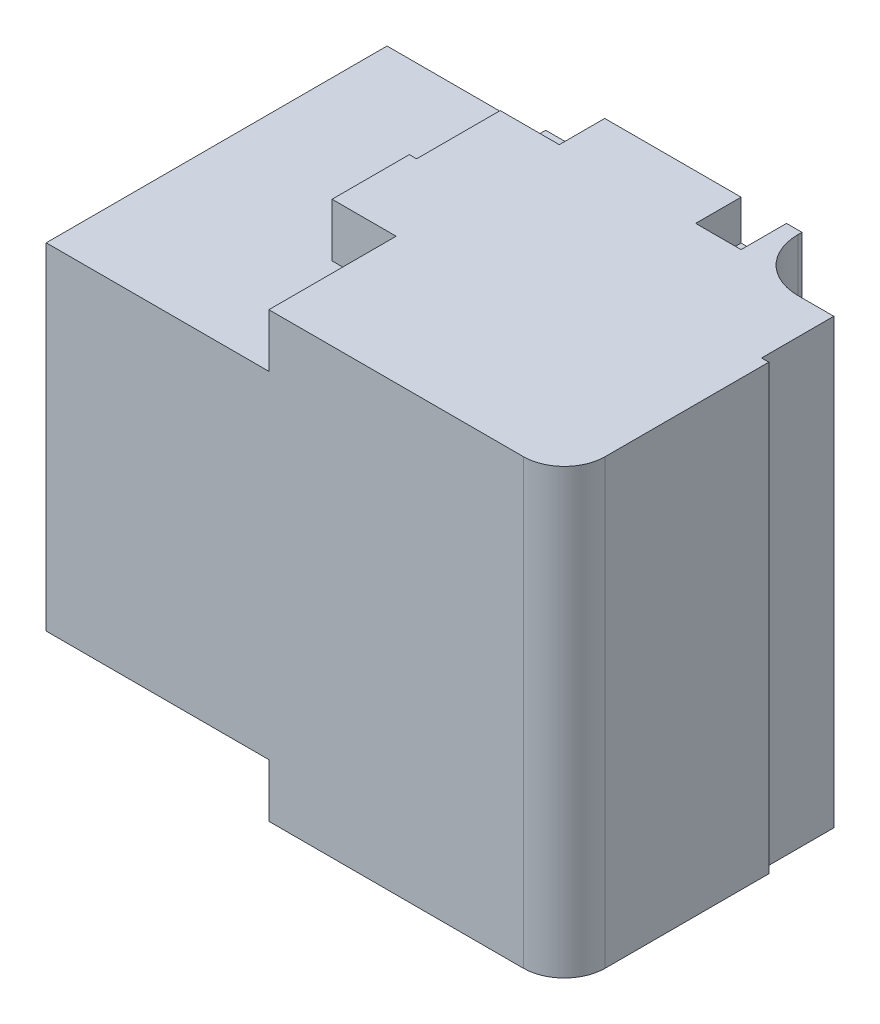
ISO-10303-21;
HEADER;
FILE_DESCRIPTION(('STEP AP214'),'2;1');
FILE_NAME('part.step','',(''),(''),'','','');
FILE_SCHEMA(('AUTOMOTIVE_DESIGN { 1 0 10303 214 1 1 1 1 }'));
ENDSEC;
DATA;
#1=APPLICATION_CONTEXT('core data for automotive mechanical design processes');
#2=APPLICATION_PROTOCOL_DEFINITION('international standard','automotive_design',2000,#1);
#3=PRODUCT_CONTEXT('',#1,'mechanical');
#4=PRODUCT('Part','Part','',(#3));
#5=PRODUCT_RELATED_PRODUCT_CATEGORY('part','',(#4));
#6=PRODUCT_DEFINITION_FORMATION('','',#4);
#7=PRODUCT_DEFINITION_CONTEXT('part definition',#1,'design');
#8=PRODUCT_DEFINITION('design','',#6,#7);
#9=PRODUCT_DEFINITION_SHAPE('','',#8);
#10=(LENGTH_UNIT() NAMED_UNIT(*) SI_UNIT(.MILLI.,.METRE.));
#11=(NAMED_UNIT(*) PLANE_ANGLE_UNIT() SI_UNIT($,.RADIAN.));
#12=(NAMED_UNIT(*) SI_UNIT($,.STERADIAN.) SOLID_ANGLE_UNIT());
#13=UNCERTAINTY_MEASURE_WITH_UNIT(LENGTH_MEASURE(1.E-05),#10,'distance_accuracy_value','');
#14=(GEOMETRIC_REPRESENTATION_CONTEXT(3) GLOBAL_UNCERTAINTY_ASSIGNED_CONTEXT((#13)) GLOBAL_UNIT_ASSIGNED_CONTEXT((#10,
#11,#12)) REPRESENTATION_CONTEXT('',''));
#15=CARTESIAN_POINT('',(0.,0.,0.));
#16=DIRECTION('',(0.,0.,1.));
#17=DIRECTION('',(1.,0.,0.));
#18=AXIS2_PLACEMENT_3D('',#15,#16,#17);
#19=CARTESIAN_POINT('',(114.935,50.8,52.832));
#20=DIRECTION('',(0.,-1.,0.));
#21=DIRECTION('',(0.,0.,-1.));
#22=AXIS2_PLACEMENT_3D('',#19,#20,#21);
#23=PLANE('',#22);
#24=DIRECTION('',(-1.,0.,0.));
#25=VECTOR('',#24,1.);
#26=CARTESIAN_POINT('',(0.,50.8,65.532));
#27=LINE('',#26,#25);
#28=CARTESIAN_POINT('',(114.935,50.8,65.532));
#29=VERTEX_POINT('',#28);
#30=CARTESIAN_POINT('',(102.235,50.8,65.532));
#31=VERTEX_POINT('',#30);
#32=EDGE_CURVE('E507',#29,#31,#27,.T.);
#33=ORIENTED_EDGE('',*,*,#32,.F.);
#34=DIRECTION('',(0.,0.,-1.));
#35=VECTOR('',#34,1.);
#36=CARTESIAN_POINT('',(114.935,50.8,52.832));
#37=LINE('',#36,#35);
#38=CARTESIAN_POINT('',(114.935,50.8,52.832));
#39=VERTEX_POINT('',#38);
#40=EDGE_CURVE('E513',#29,#39,#37,.T.);
#41=ORIENTED_EDGE('',*,*,#40,.T.);
#42=DIRECTION('',(1.,0.,0.));
#43=VECTOR('',#42,1.);
#44=CARTESIAN_POINT('',(45.593,50.8,52.832));
#45=LINE('',#44,#43);
#46=CARTESIAN_POINT('',(102.235,50.8,52.832));
#47=VERTEX_POINT('',#46);
#48=EDGE_CURVE('E380',#39,#47,#45,.F.);
#49=ORIENTED_EDGE('',*,*,#48,.T.);
#50=DIRECTION('',(0.,0.,1.));
#51=VECTOR('',#50,1.);
#52=CARTESIAN_POINT('',(102.235,50.8,52.832));
#53=LINE('',#52,#51);
#54=EDGE_CURVE('E505',#47,#31,#53,.T.);
#55=ORIENTED_EDGE('',*,*,#54,.T.);
#56=EDGE_LOOP('',(#33,#41,#49,#55));
#57=FACE_BOUND('',#56,.T.);
#58=ADVANCED_FACE('F17',(#57),#23,.F.);
#59=CARTESIAN_POINT('',(64.135,50.8,52.832));
#60=DIRECTION('',(0.,-1.,0.));
#61=DIRECTION('',(0.,0.,-1.));
#62=AXIS2_PLACEMENT_3D('',#59,#60,#61);
#63=PLANE('',#62);
#64=DIRECTION('',(0.,0.,-1.));
#65=VECTOR('',#64,1.);
#66=CARTESIAN_POINT('',(64.135,50.8,52.832));
#67=LINE('',#66,#65);
#68=CARTESIAN_POINT('',(64.135,50.8,65.532));
#69=VERTEX_POINT('',#68);
#70=CARTESIAN_POINT('',(64.135,50.8,52.832));
#71=VERTEX_POINT('',#70);
#72=EDGE_CURVE('E504',#69,#71,#67,.T.);
#73=ORIENTED_EDGE('',*,*,#72,.T.);
#74=DIRECTION('',(1.,0.,0.));
#75=VECTOR('',#74,1.);
#76=CARTESIAN_POINT('',(45.593,50.8,52.832));
#77=LINE('',#76,#75);
#78=CARTESIAN_POINT('',(47.625,50.8,52.832));
#79=VERTEX_POINT('',#78);
#80=EDGE_CURVE('E494',#71,#79,#77,.F.);
#81=ORIENTED_EDGE('',*,*,#80,.T.);
#82=DIRECTION('',(0.,0.,1.));
#83=VECTOR('',#82,1.);
#84=CARTESIAN_POINT('',(47.625,50.8,146.05));
#85=LINE('',#84,#83);
#86=CARTESIAN_POINT('',(47.625,50.8,65.532));
#87=VERTEX_POINT('',#86);
#88=EDGE_CURVE('E483',#87,#79,#85,.F.);
#89=ORIENTED_EDGE('',*,*,#88,.F.);
#90=DIRECTION('',(-1.,0.,0.));
#91=VECTOR('',#90,1.);
#92=CARTESIAN_POINT('',(0.,50.8,65.532));
#93=LINE('',#92,#91);
#94=EDGE_CURVE('E614',#69,#87,#93,.T.);
#95=ORIENTED_EDGE('',*,*,#94,.F.);
#96=EDGE_LOOP('',(#73,#81,#89,#95));
#97=FACE_BOUND('',#96,.T.);
#98=ADVANCED_FACE('F1075',(#97),#63,.F.);
#99=CARTESIAN_POINT('',(119.253,-61.9125,50.8));
#100=DIRECTION('',(-1.,0.,0.));
#101=DIRECTION('',(0.,0.,1.));
#102=AXIS2_PLACEMENT_3D('',#99,#100,#101);
#103=PLANE('',#102);
#104=DIRECTION('',(0.,1.,0.));
#105=VECTOR('',#104,1.);
#106=CARTESIAN_POINT('',(119.253,-74.295,52.832));
#107=LINE('',#106,#105);
#108=CARTESIAN_POINT('',(119.253,-61.9125,52.832));
#109=VERTEX_POINT('',#108);
#110=CARTESIAN_POINT('',(119.253,61.9125,52.832));
#111=VERTEX_POINT('',#110);
#112=EDGE_CURVE('E386',#109,#111,#107,.T.);
#113=ORIENTED_EDGE('',*,*,#112,.T.);
#114=DIRECTION('',(0.,0.,1.));
#115=VECTOR('',#114,1.);
#116=CARTESIAN_POINT('',(119.253,61.9125,50.8));
#117=LINE('',#116,#115);
#118=CARTESIAN_POINT('',(119.253,61.9125,53.975));
#119=VERTEX_POINT('',#118);
#120=EDGE_CURVE('E560',#119,#111,#117,.F.);
#121=ORIENTED_EDGE('',*,*,#120,.F.);
#122=DIRECTION('',(0.,-1.,0.));
#123=VECTOR('',#122,1.);
#124=CARTESIAN_POINT('',(119.253,223.33077,53.975));
#125=LINE('',#124,#123);
#126=CARTESIAN_POINT('',(119.253,-61.9125,53.975));
#127=VERTEX_POINT('',#126);
#128=EDGE_CURVE('E372',#119,#127,#125,.T.);
#129=ORIENTED_EDGE('',*,*,#128,.T.);
#130=DIRECTION('',(0.,0.,1.));
#131=VECTOR('',#130,1.);
#132=CARTESIAN_POINT('',(119.253,-61.9125,50.8));
#133=LINE('',#132,#131);
#134=EDGE_CURVE('E516',#109,#127,#133,.T.);
#135=ORIENTED_EDGE('',*,*,#134,.F.);
#136=EDGE_LOOP('',(#113,#121,#129,#135));
#137=FACE_BOUND('',#136,.T.);
#138=ADVANCED_FACE('F760',(#137),#103,.F.);
#139=CARTESIAN_POINT('',(45.593,-50.8,52.832));
#140=DIRECTION('',(0.,1.,0.));
#141=DIRECTION('',(0.,0.,1.));
#142=AXIS2_PLACEMENT_3D('',#139,#140,#141);
#143=PLANE('',#142);
#144=DIRECTION('',(0.,0.,-1.));
#145=VECTOR('',#144,1.);
#146=CARTESIAN_POINT('',(114.935,-50.8,52.832));
#147=LINE('',#146,#145);
#148=CARTESIAN_POINT('',(114.935,-50.8,52.832));
#149=VERTEX_POINT('',#148);
#150=CARTESIAN_POINT('',(114.935,-50.8,65.532));
#151=VERTEX_POINT('',#150);
#152=EDGE_CURVE('E592',#149,#151,#147,.F.);
#153=ORIENTED_EDGE('',*,*,#152,.T.);
#154=DIRECTION('',(-1.,0.,0.));
#155=VECTOR('',#154,1.);
#156=CARTESIAN_POINT('',(0.,-50.8,65.532));
#157=LINE('',#156,#155);
#158=CARTESIAN_POINT('',(47.625,-50.8,65.532));
#159=VERTEX_POINT('',#158);
#160=EDGE_CURVE('E407',#159,#151,#157,.F.);
#161=ORIENTED_EDGE('',*,*,#160,.F.);
#162=DIRECTION('',(0.,0.,1.));
#163=VECTOR('',#162,1.);
#164=CARTESIAN_POINT('',(47.625,-50.8,146.05));
#165=LINE('',#164,#163);
#166=CARTESIAN_POINT('',(47.625,-50.8,52.832));
#167=VERTEX_POINT('',#166);
#168=EDGE_CURVE('E431',#167,#159,#165,.T.);
#169=ORIENTED_EDGE('',*,*,#168,.F.);
#170=DIRECTION('',(1.,0.,0.));
#171=VECTOR('',#170,1.);
#172=CARTESIAN_POINT('',(45.593,-50.8,52.832));
#173=LINE('',#172,#171);
#174=EDGE_CURVE('E537',#167,#149,#173,.T.);
#175=ORIENTED_EDGE('',*,*,#174,.T.);
#176=EDGE_LOOP('',(#153,#161,#169,#175));
#177=FACE_BOUND('',#176,.T.);
#178=ADVANCED_FACE('F753',(#177),#143,.F.);
#179=CARTESIAN_POINT('',(114.935,61.9125,52.832));
#180=DIRECTION('',(1.,0.,0.));
#181=DIRECTION('',(0.,0.,-1.));
#182=AXIS2_PLACEMENT_3D('',#179,#180,#181);
#183=PLANE('',#182);
#184=ORIENTED_EDGE('',*,*,#40,.F.);
#185=DIRECTION('',(0.,1.,0.));
#186=VECTOR('',#185,1.);
#187=CARTESIAN_POINT('',(114.935,-74.295,65.532));
#188=LINE('',#187,#186);
#189=CARTESIAN_POINT('',(114.935,61.9125,65.532));
#190=VERTEX_POINT('',#189);
#191=EDGE_CURVE('E510',#190,#29,#188,.F.);
#192=ORIENTED_EDGE('',*,*,#191,.F.);
#193=DIRECTION('',(0.,0.,1.));
#194=VECTOR('',#193,1.);
#195=CARTESIAN_POINT('',(114.935,61.9125,50.8));
#196=LINE('',#195,#194);
#197=CARTESIAN_POINT('',(114.935,61.9125,52.832));
#198=VERTEX_POINT('',#197);
#199=EDGE_CURVE('E329',#198,#190,#196,.T.);
#200=ORIENTED_EDGE('',*,*,#199,.F.);
#201=DIRECTION('',(0.,1.,0.));
#202=VECTOR('',#201,1.);
#203=CARTESIAN_POINT('',(114.935,-74.295,52.832));
#204=LINE('',#203,#202);
#205=EDGE_CURVE('E383',#198,#39,#204,.F.);
#206=ORIENTED_EDGE('',*,*,#205,.T.);
#207=EDGE_LOOP('',(#184,#192,#200,#206));
#208=FACE_BOUND('',#207,.T.);
#209=ADVANCED_FACE('F1048',(#208),#183,.F.);
#210=CARTESIAN_POINT('',(0.,-74.295,65.532));
#211=DIRECTION('',(0.,0.,-1.));
#212=DIRECTION('',(-1.,0.,0.));
#213=AXIS2_PLACEMENT_3D('',#210,#211,#212);
#214=PLANE('',#213);
#215=DIRECTION('',(0.,1.,0.));
#216=VECTOR('',#215,1.);
#217=CARTESIAN_POINT('',(102.235,50.8,65.532));
#218=LINE('',#217,#216);
#219=CARTESIAN_POINT('',(102.235,61.9125,65.532));
#220=VERTEX_POINT('',#219);
#221=EDGE_CURVE('E501',#31,#220,#218,.T.);
#222=ORIENTED_EDGE('',*,*,#221,.T.);
#223=DIRECTION('',(1.,0.,0.));
#224=VECTOR('',#223,1.);
#225=CARTESIAN_POINT('',(146.05,61.9125,65.532));
#226=LINE('',#225,#224);
#227=EDGE_CURVE('E326',#190,#220,#226,.F.);
#228=ORIENTED_EDGE('',*,*,#227,.F.);
#229=ORIENTED_EDGE('',*,*,#191,.T.);
#230=ORIENTED_EDGE('',*,*,#32,.T.);
#231=EDGE_LOOP('',(#222,#228,#229,#230));
#232=FACE_BOUND('',#231,.T.);
#233=ADVANCED_FACE('F1039',(#232),#214,.T.);
#234=CARTESIAN_POINT('',(102.235,50.8,52.832));
#235=DIRECTION('',(-1.,0.,0.));
#236=DIRECTION('',(0.,0.,1.));
#237=AXIS2_PLACEMENT_3D('',#234,#235,#236);
#238=PLANE('',#237);
#239=ORIENTED_EDGE('',*,*,#54,.F.);
#240=DIRECTION('',(0.,1.,0.));
#241=VECTOR('',#240,1.);
#242=CARTESIAN_POINT('',(102.235,-74.295,52.832));
#243=LINE('',#242,#241);
#244=CARTESIAN_POINT('',(102.235,61.9125,52.832));
#245=VERTEX_POINT('',#244);
#246=EDGE_CURVE('E376',#47,#245,#243,.T.);
#247=ORIENTED_EDGE('',*,*,#246,.T.);
#248=DIRECTION('',(0.,0.,1.));
#249=VECTOR('',#248,1.);
#250=CARTESIAN_POINT('',(102.235,61.9125,50.8));
#251=LINE('',#250,#249);
#252=EDGE_CURVE('E322',#220,#245,#251,.F.);
#253=ORIENTED_EDGE('',*,*,#252,.F.);
#254=ORIENTED_EDGE('',*,*,#221,.F.);
#255=EDGE_LOOP('',(#239,#247,#253,#254));
#256=FACE_BOUND('',#255,.T.);
#257=ADVANCED_FACE('F1029',(#256),#238,.F.);
#258=CARTESIAN_POINT('',(64.135,61.9125,52.832));
#259=DIRECTION('',(1.,0.,0.));
#260=DIRECTION('',(0.,0.,-1.));
#261=AXIS2_PLACEMENT_3D('',#258,#259,#260);
#262=PLANE('',#261);
#263=ORIENTED_EDGE('',*,*,#72,.F.);
#264=DIRECTION('',(0.,1.,0.));
#265=VECTOR('',#264,1.);
#266=CARTESIAN_POINT('',(64.135,-74.295,65.532));
#267=LINE('',#266,#265);
#268=CARTESIAN_POINT('',(64.135,61.9125,65.532));
#269=VERTEX_POINT('',#268);
#270=EDGE_CURVE('E580',#269,#69,#267,.F.);
#271=ORIENTED_EDGE('',*,*,#270,.F.);
#272=DIRECTION('',(0.,0.,1.));
#273=VECTOR('',#272,1.);
#274=CARTESIAN_POINT('',(64.135,61.9125,50.8));
#275=LINE('',#274,#273);
#276=CARTESIAN_POINT('',(64.135,61.9125,52.832));
#277=VERTEX_POINT('',#276);
#278=EDGE_CURVE('E583',#277,#269,#275,.T.);
#279=ORIENTED_EDGE('',*,*,#278,.F.);
#280=DIRECTION('',(0.,1.,0.));
#281=VECTOR('',#280,1.);
#282=CARTESIAN_POINT('',(64.135,-74.295,52.832));
#283=LINE('',#282,#281);
#284=EDGE_CURVE('E379',#277,#71,#283,.F.);
#285=ORIENTED_EDGE('',*,*,#284,.T.);
#286=EDGE_LOOP('',(#263,#271,#279,#285));
#287=FACE_BOUND('',#286,.T.);
#288=ADVANCED_FACE('F1020',(#287),#262,.F.);
#289=CARTESIAN_POINT('',(0.,-74.295,65.532));
#290=DIRECTION('',(0.,0.,-1.));
#291=DIRECTION('',(-1.,0.,0.));
#292=AXIS2_PLACEMENT_3D('',#289,#290,#291);
#293=PLANE('',#292);
#294=ORIENTED_EDGE('',*,*,#94,.T.);
#295=DIRECTION('',(0.,1.,0.));
#296=VECTOR('',#295,1.);
#297=CARTESIAN_POINT('',(47.625,0.,65.532));
#298=LINE('',#297,#296);
#299=CARTESIAN_POINT('',(47.625,61.9125,65.532));
#300=VERTEX_POINT('',#299);
#301=EDGE_CURVE('E569',#300,#87,#298,.F.);
#302=ORIENTED_EDGE('',*,*,#301,.F.);
#303=DIRECTION('',(1.,0.,0.));
#304=VECTOR('',#303,1.);
#305=CARTESIAN_POINT('',(146.05,61.9125,65.532));
#306=LINE('',#305,#304);
#307=EDGE_CURVE('E534',#269,#300,#306,.F.);
#308=ORIENTED_EDGE('',*,*,#307,.F.);
#309=ORIENTED_EDGE('',*,*,#270,.T.);
#310=EDGE_LOOP('',(#294,#302,#308,#309));
#311=FACE_BOUND('',#310,.T.);
#312=ADVANCED_FACE('F1011',(#311),#293,.T.);
#313=CARTESIAN_POINT('',(47.625,0.,146.05));
#314=DIRECTION('',(-1.,0.,0.));
#315=DIRECTION('',(0.,0.,1.));
#316=AXIS2_PLACEMENT_3D('',#313,#314,#315);
#317=PLANE('',#316);
#318=DIRECTION('',(0.,1.,0.));
#319=VECTOR('',#318,1.);
#320=CARTESIAN_POINT('',(47.625,46.99,88.9));
#321=LINE('',#320,#319);
#322=CARTESIAN_POINT('',(47.625,46.99,88.9));
#323=VERTEX_POINT('',#322);
#324=CARTESIAN_POINT('',(47.625,61.9125,88.9));
#325=VERTEX_POINT('',#324);
#326=EDGE_CURVE('E475',#323,#325,#321,.T.);
#327=ORIENTED_EDGE('',*,*,#326,.T.);
#328=DIRECTION('',(0.,0.,1.));
#329=VECTOR('',#328,1.);
#330=CARTESIAN_POINT('',(47.625,61.9125,50.8));
#331=LINE('',#330,#329);
#332=EDGE_CURVE('E458',#300,#325,#331,.T.);
#333=ORIENTED_EDGE('',*,*,#332,.F.);
#334=ORIENTED_EDGE('',*,*,#301,.T.);
#335=ORIENTED_EDGE('',*,*,#88,.T.);
#336=DIRECTION('',(0.,1.,0.));
#337=VECTOR('',#336,1.);
#338=CARTESIAN_POINT('',(47.625,-74.295,52.832));
#339=LINE('',#338,#337);
#340=CARTESIAN_POINT('',(47.625,46.99,52.832));
#341=VERTEX_POINT('',#340);
#342=EDGE_CURVE('E421',#79,#341,#339,.F.);
#343=ORIENTED_EDGE('',*,*,#342,.T.);
#344=DIRECTION('',(0.,0.,-1.));
#345=VECTOR('',#344,1.);
#346=CARTESIAN_POINT('',(47.625,46.99,146.05));
#347=LINE('',#346,#345);
#348=EDGE_CURVE('E479',#341,#323,#347,.F.);
#349=ORIENTED_EDGE('',*,*,#348,.T.);
#350=EDGE_LOOP('',(#327,#333,#334,#335,#343,#349));
#351=FACE_BOUND('',#350,.T.);
#352=ADVANCED_FACE('F736',(#351),#317,.T.);
#353=CARTESIAN_POINT('',(45.593,46.99,88.9));
#354=DIRECTION('',(0.,0.,1.));
#355=DIRECTION('',(1.,0.,0.));
#356=AXIS2_PLACEMENT_3D('',#353,#354,#355);
#357=PLANE('',#356);
#358=DIRECTION('',(1.,0.,0.));
#359=VECTOR('',#358,1.);
#360=CARTESIAN_POINT('',(1.27,46.99,88.9));
#361=LINE('',#360,#359);
#362=CARTESIAN_POINT('',(45.593,46.99,88.9));
#363=VERTEX_POINT('',#362);
#364=EDGE_CURVE('E471',#323,#363,#361,.F.);
#365=ORIENTED_EDGE('',*,*,#364,.T.);
#366=DIRECTION('',(0.,1.,0.));
#367=VECTOR('',#366,1.);
#368=CARTESIAN_POINT('',(45.593,46.99,88.9));
#369=LINE('',#368,#367);
#370=CARTESIAN_POINT('',(45.593,61.9125,88.9));
#371=VERTEX_POINT('',#370);
#372=EDGE_CURVE('E467',#363,#371,#369,.T.);
#373=ORIENTED_EDGE('',*,*,#372,.T.);
#374=DIRECTION('',(1.,0.,0.));
#375=VECTOR('',#374,1.);
#376=CARTESIAN_POINT('',(146.05,61.9125,88.9));
#377=LINE('',#376,#375);
#378=EDGE_CURVE('E356',#325,#371,#377,.F.);
#379=ORIENTED_EDGE('',*,*,#378,.F.);
#380=ORIENTED_EDGE('',*,*,#326,.F.);
#381=EDGE_LOOP('',(#365,#373,#379,#380));
#382=FACE_BOUND('',#381,.T.);
#383=ADVANCED_FACE('F733',(#382),#357,.F.);
#384=CARTESIAN_POINT('',(45.593,46.99,146.05));
#385=DIRECTION('',(1.,0.,0.));
#386=DIRECTION('',(0.,0.,-1.));
#387=AXIS2_PLACEMENT_3D('',#384,#385,#386);
#388=PLANE('',#387);
#389=DIRECTION('',(0.,1.,0.));
#390=VECTOR('',#389,1.);
#391=CARTESIAN_POINT('',(45.593,0.,110.49));
#392=LINE('',#391,#390);
#393=CARTESIAN_POINT('',(45.593,61.9125,110.49));
#394=VERTEX_POINT('',#393);
#395=CARTESIAN_POINT('',(45.593,46.99,110.49));
#396=VERTEX_POINT('',#395);
#397=EDGE_CURVE('E408',#394,#396,#392,.F.);
#398=ORIENTED_EDGE('',*,*,#397,.F.);
#399=DIRECTION('',(0.,0.,1.));
#400=VECTOR('',#399,1.);
#401=CARTESIAN_POINT('',(45.593,61.9125,50.8));
#402=LINE('',#401,#400);
#403=EDGE_CURVE('E498',#371,#394,#402,.T.);
#404=ORIENTED_EDGE('',*,*,#403,.F.);
#405=ORIENTED_EDGE('',*,*,#372,.F.);
#406=DIRECTION('',(0.,0.,-1.));
#407=VECTOR('',#406,1.);
#408=CARTESIAN_POINT('',(45.593,46.99,146.05));
#409=LINE('',#408,#407);
#410=EDGE_CURVE('E462',#363,#396,#409,.F.);
#411=ORIENTED_EDGE('',*,*,#410,.T.);
#412=EDGE_LOOP('',(#398,#404,#405,#411));
#413=FACE_BOUND('',#412,.T.);
#414=ADVANCED_FACE('F728',(#413),#388,.F.);
#415=CARTESIAN_POINT('',(0.,0.,110.49));
#416=DIRECTION('',(0.,0.,1.));
#417=DIRECTION('',(1.,0.,0.));
#418=AXIS2_PLACEMENT_3D('',#415,#416,#417);
#419=PLANE('',#418);
#420=DIRECTION('',(0.,1.,0.));
#421=VECTOR('',#420,1.);
#422=CARTESIAN_POINT('',(63.5,46.99,110.49));
#423=LINE('',#422,#421);
#424=CARTESIAN_POINT('',(63.5,46.99,110.49));
#425=VERTEX_POINT('',#424);
#426=CARTESIAN_POINT('',(63.5,61.9125,110.49));
#427=VERTEX_POINT('',#426);
#428=EDGE_CURVE('E315',#425,#427,#423,.T.);
#429=ORIENTED_EDGE('',*,*,#428,.T.);
#430=DIRECTION('',(1.,0.,0.));
#431=VECTOR('',#430,1.);
#432=CARTESIAN_POINT('',(146.05,61.9125,110.49));
#433=LINE('',#432,#431);
#434=EDGE_CURVE('E339',#394,#427,#433,.T.);
#435=ORIENTED_EDGE('',*,*,#434,.F.);
#436=ORIENTED_EDGE('',*,*,#397,.T.);
#437=DIRECTION('',(1.,0.,0.));
#438=VECTOR('',#437,1.);
#439=CARTESIAN_POINT('',(1.27,46.99,110.49));
#440=LINE('',#439,#438);
#441=EDGE_CURVE('E306',#396,#425,#440,.T.);
#442=ORIENTED_EDGE('',*,*,#441,.T.);
#443=EDGE_LOOP('',(#429,#435,#436,#442));
#444=FACE_BOUND('',#443,.T.);
#445=ADVANCED_FACE('F722',(#444),#419,.T.);
#446=CARTESIAN_POINT('',(45.593,-74.295,50.8));
#447=DIRECTION('',(-1.,0.,0.));
#448=DIRECTION('',(0.,0.,1.));
#449=AXIS2_PLACEMENT_3D('',#446,#447,#448);
#450=PLANE('',#449);
#451=DIRECTION('',(0.,0.,-1.));
#452=VECTOR('',#451,1.);
#453=CARTESIAN_POINT('',(45.593,46.99,146.05));
#454=LINE('',#453,#452);
#455=CARTESIAN_POINT('',(45.593,46.99,50.8));
#456=VERTEX_POINT('',#455);
#457=CARTESIAN_POINT('',(45.593,46.99,52.832));
#458=VERTEX_POINT('',#457);
#459=EDGE_CURVE('E314',#456,#458,#454,.F.);
#460=ORIENTED_EDGE('',*,*,#459,.T.);
#461=DIRECTION('',(0.,1.,0.));
#462=VECTOR('',#461,1.);
#463=CARTESIAN_POINT('',(45.593,-74.295,52.832));
#464=LINE('',#463,#462);
#465=CARTESIAN_POINT('',(45.593,-46.99,52.832));
#466=VERTEX_POINT('',#465);
#467=EDGE_CURVE('E375',#458,#466,#464,.F.);
#468=ORIENTED_EDGE('',*,*,#467,.T.);
#469=DIRECTION('',(0.,0.,1.));
#470=VECTOR('',#469,1.);
#471=CARTESIAN_POINT('',(45.593,-46.99,146.05));
#472=LINE('',#471,#470);
#473=CARTESIAN_POINT('',(45.593,-46.99,50.8));
#474=VERTEX_POINT('',#473);
#475=EDGE_CURVE('E402',#466,#474,#472,.F.);
#476=ORIENTED_EDGE('',*,*,#475,.T.);
#477=DIRECTION('',(0.,1.,0.));
#478=VECTOR('',#477,1.);
#479=CARTESIAN_POINT('',(45.593,0.,50.8));
#480=LINE('',#479,#478);
#481=EDGE_CURVE('E405',#474,#456,#480,.T.);
#482=ORIENTED_EDGE('',*,*,#481,.T.);
#483=EDGE_LOOP('',(#460,#468,#476,#482));
#484=FACE_BOUND('',#483,.T.);
#485=ADVANCED_FACE('F746',(#484),#450,.F.);
#486=CARTESIAN_POINT('',(0.,0.,50.8));
#487=DIRECTION('',(0.,0.,1.));
#488=DIRECTION('',(1.,0.,0.));
#489=AXIS2_PLACEMENT_3D('',#486,#487,#488);
#490=PLANE('',#489);
#491=DIRECTION('',(0.,1.,0.));
#492=VECTOR('',#491,1.);
#493=CARTESIAN_POINT('',(1.27,61.9125,50.8));
#494=LINE('',#493,#492);
#495=CARTESIAN_POINT('',(1.27,46.99,50.8));
#496=VERTEX_POINT('',#495);
#497=CARTESIAN_POINT('',(1.27,-46.99,50.8));
#498=VERTEX_POINT('',#497);
#499=EDGE_CURVE('E295',#496,#498,#494,.F.);
#500=ORIENTED_EDGE('',*,*,#499,.F.);
#501=DIRECTION('',(1.,0.,0.));
#502=VECTOR('',#501,1.);
#503=CARTESIAN_POINT('',(1.27,46.99,50.8));
#504=LINE('',#503,#502);
#505=EDGE_CURVE('E296',#496,#456,#504,.T.);
#506=ORIENTED_EDGE('',*,*,#505,.T.);
#507=ORIENTED_EDGE('',*,*,#481,.F.);
#508=DIRECTION('',(1.,0.,0.));
#509=VECTOR('',#508,1.);
#510=CARTESIAN_POINT('',(45.593,-46.99,50.8));
#511=LINE('',#510,#509);
#512=EDGE_CURVE('E284',#474,#498,#511,.F.);
#513=ORIENTED_EDGE('',*,*,#512,.T.);
#514=EDGE_LOOP('',(#500,#506,#507,#513));
#515=FACE_BOUND('',#514,.T.);
#516=ADVANCED_FACE('F708',(#515),#490,.F.);
#517=CARTESIAN_POINT('',(0.,-74.295,65.532));
#518=DIRECTION('',(0.,0.,-1.));
#519=DIRECTION('',(-1.,0.,0.));
#520=AXIS2_PLACEMENT_3D('',#517,#518,#519);
#521=PLANE('',#520);
#522=DIRECTION('',(1.,0.,0.));
#523=VECTOR('',#522,1.);
#524=CARTESIAN_POINT('',(1.27,-61.9125,65.532));
#525=LINE('',#524,#523);
#526=CARTESIAN_POINT('',(47.625,-61.9125,65.532));
#527=VERTEX_POINT('',#526);
#528=CARTESIAN_POINT('',(114.935,-61.9125,65.532));
#529=VERTEX_POINT('',#528);
#530=EDGE_CURVE('E249',#527,#529,#525,.T.);
#531=ORIENTED_EDGE('',*,*,#530,.F.);
#532=DIRECTION('',(0.,1.,0.));
#533=VECTOR('',#532,1.);
#534=CARTESIAN_POINT('',(47.625,0.,65.532));
#535=LINE('',#534,#533);
#536=EDGE_CURVE('E357',#159,#527,#535,.F.);
#537=ORIENTED_EDGE('',*,*,#536,.F.);
#538=ORIENTED_EDGE('',*,*,#160,.T.);
#539=DIRECTION('',(0.,1.,0.));
#540=VECTOR('',#539,1.);
#541=CARTESIAN_POINT('',(114.935,-50.8,65.532));
#542=LINE('',#541,#540);
#543=EDGE_CURVE('E540',#151,#529,#542,.F.);
#544=ORIENTED_EDGE('',*,*,#543,.T.);
#545=EDGE_LOOP('',(#531,#537,#538,#544));
#546=FACE_BOUND('',#545,.T.);
#547=ADVANCED_FACE('F676',(#546),#521,.T.);
#548=CARTESIAN_POINT('',(114.935,-50.8,52.832));
#549=DIRECTION('',(1.,0.,0.));
#550=DIRECTION('',(0.,0.,-1.));
#551=AXIS2_PLACEMENT_3D('',#548,#549,#550);
#552=PLANE('',#551);
#553=ORIENTED_EDGE('',*,*,#152,.F.);
#554=DIRECTION('',(0.,1.,0.));
#555=VECTOR('',#554,1.);
#556=CARTESIAN_POINT('',(114.935,-74.295,52.832));
#557=LINE('',#556,#555);
#558=CARTESIAN_POINT('',(114.935,-61.9125,52.832));
#559=VERTEX_POINT('',#558);
#560=EDGE_CURVE('E539',#149,#559,#557,.F.);
#561=ORIENTED_EDGE('',*,*,#560,.T.);
#562=DIRECTION('',(0.,0.,-1.));
#563=VECTOR('',#562,1.);
#564=CARTESIAN_POINT('',(114.935,-61.9125,50.8));
#565=LINE('',#564,#563);
#566=EDGE_CURVE('E246',#529,#559,#565,.T.);
#567=ORIENTED_EDGE('',*,*,#566,.F.);
#568=ORIENTED_EDGE('',*,*,#543,.F.);
#569=EDGE_LOOP('',(#553,#561,#567,#568));
#570=FACE_BOUND('',#569,.T.);
#571=ADVANCED_FACE('F755',(#570),#552,.F.);
#572=CARTESIAN_POINT('',(45.593,-74.295,52.832));
#573=DIRECTION('',(0.,0.,1.));
#574=DIRECTION('',(1.,0.,0.));
#575=AXIS2_PLACEMENT_3D('',#572,#573,#574);
#576=PLANE('',#575);
#577=ORIENTED_EDGE('',*,*,#467,.F.);
#578=DIRECTION('',(1.,0.,0.));
#579=VECTOR('',#578,1.);
#580=CARTESIAN_POINT('',(1.27,46.99,52.832));
#581=LINE('',#580,#579);
#582=EDGE_CURVE('E454',#458,#341,#581,.T.);
#583=ORIENTED_EDGE('',*,*,#582,.T.);
#584=ORIENTED_EDGE('',*,*,#342,.F.);
#585=ORIENTED_EDGE('',*,*,#80,.F.);
#586=ORIENTED_EDGE('',*,*,#284,.F.);
#587=DIRECTION('',(1.,0.,0.));
#588=VECTOR('',#587,1.);
#589=CARTESIAN_POINT('',(146.05,61.9125,52.832));
#590=LINE('',#589,#588);
#591=EDGE_CURVE('E325',#245,#277,#590,.F.);
#592=ORIENTED_EDGE('',*,*,#591,.F.);
#593=ORIENTED_EDGE('',*,*,#246,.F.);
#594=ORIENTED_EDGE('',*,*,#48,.F.);
#595=ORIENTED_EDGE('',*,*,#205,.F.);
#596=DIRECTION('',(1.,0.,0.));
#597=VECTOR('',#596,1.);
#598=CARTESIAN_POINT('',(146.05,61.9125,52.832));
#599=LINE('',#598,#597);
#600=EDGE_CURVE('E332',#111,#198,#599,.F.);
#601=ORIENTED_EDGE('',*,*,#600,.F.);
#602=ORIENTED_EDGE('',*,*,#112,.F.);
#603=DIRECTION('',(1.,0.,0.));
#604=VECTOR('',#603,1.);
#605=CARTESIAN_POINT('',(1.27,-61.9125,52.832));
#606=LINE('',#605,#604);
#607=EDGE_CURVE('E239',#559,#109,#606,.T.);
#608=ORIENTED_EDGE('',*,*,#607,.F.);
#609=ORIENTED_EDGE('',*,*,#560,.F.);
#610=ORIENTED_EDGE('',*,*,#174,.F.);
#611=DIRECTION('',(0.,1.,0.));
#612=VECTOR('',#611,1.);
#613=CARTESIAN_POINT('',(47.625,0.,52.832));
#614=LINE('',#613,#612);
#615=CARTESIAN_POINT('',(47.625,-46.99,52.832));
#616=VERTEX_POINT('',#615);
#617=EDGE_CURVE('E428',#616,#167,#614,.F.);
#618=ORIENTED_EDGE('',*,*,#617,.F.);
#619=DIRECTION('',(1.,0.,0.));
#620=VECTOR('',#619,1.);
#621=CARTESIAN_POINT('',(45.593,-46.99,52.832));
#622=LINE('',#621,#620);
#623=EDGE_CURVE('E412',#616,#466,#622,.F.);
#624=ORIENTED_EDGE('',*,*,#623,.T.);
#625=EDGE_LOOP('',(#577,#583,#584,#585,#586,#592,#593,#594,#595,#601,#602,#608,#609,#610,#618,#624));
#626=FACE_BOUND('',#625,.T.);
#627=ADVANCED_FACE('F742',(#626),#576,.F.);
#628=CARTESIAN_POINT('',(133.985,223.33077,53.975));
#629=DIRECTION('',(0.,-1.,0.));
#630=DIRECTION('',(0.,0.,-1.));
#631=AXIS2_PLACEMENT_3D('',#628,#629,#630);
#632=CYLINDRICAL_SURFACE('',#631,14.732);
#633=ORIENTED_EDGE('',*,*,#128,.F.);
#634=CARTESIAN_POINT('',(133.985,61.9125,53.975));
#635=DIRECTION('',(0.,-1.,0.));
#636=DIRECTION('',(0.,0.,-1.));
#637=AXIS2_PLACEMENT_3D('',#634,#635,#636);
#638=CIRCLE('',#637,14.732);
#639=CARTESIAN_POINT('',(133.985,61.9125,68.707));
#640=VERTEX_POINT('',#639);
#641=EDGE_CURVE('E20',#640,#119,#638,.T.);
#642=ORIENTED_EDGE('',*,*,#641,.F.);
#643=DIRECTION('',(0.,1.,0.));
#644=VECTOR('',#643,1.);
#645=CARTESIAN_POINT('',(133.985,0.,68.707));
#646=LINE('',#645,#644);
#647=CARTESIAN_POINT('',(133.985,-61.9125,68.707));
#648=VERTEX_POINT('',#647);
#649=EDGE_CURVE('E61',#648,#640,#646,.T.);
#650=ORIENTED_EDGE('',*,*,#649,.F.);
#651=CARTESIAN_POINT('',(133.985,-61.9125,53.975));
#652=DIRECTION('',(0.,-1.,0.));
#653=DIRECTION('',(0.,0.,-1.));
#654=AXIS2_PLACEMENT_3D('',#651,#652,#653);
#655=CIRCLE('',#654,14.732);
#656=EDGE_CURVE('E237',#127,#648,#655,.F.);
#657=ORIENTED_EDGE('',*,*,#656,.F.);
#658=EDGE_LOOP('',(#633,#642,#650,#657));
#659=FACE_BOUND('',#658,.T.);
#660=ADVANCED_FACE('F763',(#659),#632,.F.);
#661=CARTESIAN_POINT('',(0.,0.,68.707));
#662=DIRECTION('',(0.,0.,-1.));
#663=DIRECTION('',(-1.,0.,0.));
#664=AXIS2_PLACEMENT_3D('',#661,#662,#663);
#665=PLANE('',#664);
#666=DIRECTION('',(1.,0.,0.));
#667=VECTOR('',#666,1.);
#668=CARTESIAN_POINT('',(1.27,-61.9125,68.707));
#669=LINE('',#668,#667);
#670=CARTESIAN_POINT('',(144.018,-61.9125,68.707));
#671=VERTEX_POINT('',#670);
#672=EDGE_CURVE('E222',#648,#671,#669,.T.);
#673=ORIENTED_EDGE('',*,*,#672,.F.);
#674=ORIENTED_EDGE('',*,*,#649,.T.);
#675=DIRECTION('',(1.,0.,0.));
#676=VECTOR('',#675,1.);
#677=CARTESIAN_POINT('',(146.05,61.9125,68.707));
#678=LINE('',#677,#676);
#679=CARTESIAN_POINT('',(144.018,61.9125,68.707));
#680=VERTEX_POINT('',#679);
#681=EDGE_CURVE('E225',#680,#640,#678,.F.);
#682=ORIENTED_EDGE('',*,*,#681,.F.);
#683=DIRECTION('',(0.,1.,0.));
#684=VECTOR('',#683,1.);
#685=CARTESIAN_POINT('',(144.018,-74.295,68.707));
#686=LINE('',#685,#684);
#687=EDGE_CURVE('E72',#680,#671,#686,.F.);
#688=ORIENTED_EDGE('',*,*,#687,.T.);
#689=EDGE_LOOP('',(#673,#674,#682,#688));
#690=FACE_BOUND('',#689,.T.);
#691=ADVANCED_FACE('F220',(#690),#665,.T.);
#692=CARTESIAN_POINT('',(144.018,-74.295,68.707));
#693=DIRECTION('',(-1.,0.,0.));
#694=DIRECTION('',(0.,0.,1.));
#695=AXIS2_PLACEMENT_3D('',#692,#693,#694);
#696=PLANE('',#695);
#697=DIRECTION('',(0.,0.,1.));
#698=VECTOR('',#697,1.);
#699=CARTESIAN_POINT('',(144.018,61.9125,50.8));
#700=LINE('',#699,#698);
#701=CARTESIAN_POINT('',(144.018,61.9125,88.9));
#702=VERTEX_POINT('',#701);
#703=EDGE_CURVE('E334',#702,#680,#700,.F.);
#704=ORIENTED_EDGE('',*,*,#703,.F.);
#705=DIRECTION('',(0.,1.,0.));
#706=VECTOR('',#705,1.);
#707=CARTESIAN_POINT('',(144.018,-74.295,88.9));
#708=LINE('',#707,#706);
#709=CARTESIAN_POINT('',(144.018,-61.9125,88.9));
#710=VERTEX_POINT('',#709);
#711=EDGE_CURVE('E218',#702,#710,#708,.F.);
#712=ORIENTED_EDGE('',*,*,#711,.T.);
#713=DIRECTION('',(0.,0.,-1.));
#714=VECTOR('',#713,1.);
#715=CARTESIAN_POINT('',(144.018,-61.9125,50.8));
#716=LINE('',#715,#714);
#717=EDGE_CURVE('E229',#671,#710,#716,.F.);
#718=ORIENTED_EDGE('',*,*,#717,.F.);
#719=ORIENTED_EDGE('',*,*,#687,.F.);
#720=EDGE_LOOP('',(#704,#712,#718,#719));
#721=FACE_BOUND('',#720,.T.);
#722=ADVANCED_FACE('F230',(#721),#696,.F.);
#723=CARTESIAN_POINT('',(144.018,-74.295,88.9));
#724=DIRECTION('',(0.,0.,1.));
#725=DIRECTION('',(1.,0.,0.));
#726=AXIS2_PLACEMENT_3D('',#723,#724,#725);
#727=PLANE('',#726);
#728=DIRECTION('',(1.,0.,0.));
#729=VECTOR('',#728,1.);
#730=CARTESIAN_POINT('',(146.05,61.9125,88.9));
#731=LINE('',#730,#729);
#732=CARTESIAN_POINT('',(146.05,61.9125,88.9));
#733=VERTEX_POINT('',#732);
#734=EDGE_CURVE('E338',#733,#702,#731,.F.);
#735=ORIENTED_EDGE('',*,*,#734,.F.);
#736=DIRECTION('',(0.,1.,0.));
#737=VECTOR('',#736,1.);
#738=CARTESIAN_POINT('',(146.05,-61.9125,88.9));
#739=LINE('',#738,#737);
#740=CARTESIAN_POINT('',(146.05,-61.9125,88.9));
#741=VERTEX_POINT('',#740);
#742=EDGE_CURVE('E354',#741,#733,#739,.T.);
#743=ORIENTED_EDGE('',*,*,#742,.F.);
#744=DIRECTION('',(1.,0.,0.));
#745=VECTOR('',#744,1.);
#746=CARTESIAN_POINT('',(1.27,-61.9125,88.9));
#747=LINE('',#746,#745);
#748=EDGE_CURVE('E232',#710,#741,#747,.T.);
#749=ORIENTED_EDGE('',*,*,#748,.F.);
#750=ORIENTED_EDGE('',*,*,#711,.F.);
#751=EDGE_LOOP('',(#735,#743,#749,#750));
#752=FACE_BOUND('',#751,.T.);
#753=ADVANCED_FACE('F766',(#752),#727,.F.);
#754=CARTESIAN_POINT('',(0.,0.,110.49));
#755=DIRECTION('',(0.,0.,1.));
#756=DIRECTION('',(1.,0.,0.));
#757=AXIS2_PLACEMENT_3D('',#754,#755,#756);
#758=PLANE('',#757);
#759=DIRECTION('',(0.,1.,0.));
#760=VECTOR('',#759,1.);
#761=CARTESIAN_POINT('',(45.593,-61.9125,110.49));
#762=LINE('',#761,#760);
#763=CARTESIAN_POINT('',(45.593,-46.99,110.49));
#764=VERTEX_POINT('',#763);
#765=CARTESIAN_POINT('',(45.593,-61.9125,110.49));
#766=VERTEX_POINT('',#765);
#767=EDGE_CURVE('E364',#764,#766,#762,.F.);
#768=ORIENTED_EDGE('',*,*,#767,.T.);
#769=DIRECTION('',(1.,0.,0.));
#770=VECTOR('',#769,1.);
#771=CARTESIAN_POINT('',(1.27,-61.9125,110.49));
#772=LINE('',#771,#770);
#773=CARTESIAN_POINT('',(63.5,-61.9125,110.49));
#774=VERTEX_POINT('',#773);
#775=EDGE_CURVE('E261',#774,#766,#772,.F.);
#776=ORIENTED_EDGE('',*,*,#775,.F.);
#777=DIRECTION('',(0.,1.,0.));
#778=VECTOR('',#777,1.);
#779=CARTESIAN_POINT('',(63.5,-61.9125,110.49));
#780=LINE('',#779,#778);
#781=CARTESIAN_POINT('',(63.5,-46.99,110.49));
#782=VERTEX_POINT('',#781);
#783=EDGE_CURVE('E272',#774,#782,#780,.T.);
#784=ORIENTED_EDGE('',*,*,#783,.T.);
#785=DIRECTION('',(1.,0.,0.));
#786=VECTOR('',#785,1.);
#787=CARTESIAN_POINT('',(45.593,-46.99,110.49));
#788=LINE('',#787,#786);
#789=EDGE_CURVE('E283',#782,#764,#788,.F.);
#790=ORIENTED_EDGE('',*,*,#789,.T.);
#791=EDGE_LOOP('',(#768,#776,#784,#790));
#792=FACE_BOUND('',#791,.T.);
#793=ADVANCED_FACE('F655',(#792),#758,.T.);
#794=CARTESIAN_POINT('',(45.593,-61.9125,146.05));
#795=DIRECTION('',(1.,0.,0.));
#796=DIRECTION('',(0.,0.,-1.));
#797=AXIS2_PLACEMENT_3D('',#794,#795,#796);
#798=PLANE('',#797);
#799=ORIENTED_EDGE('',*,*,#767,.F.);
#800=DIRECTION('',(0.,0.,1.));
#801=VECTOR('',#800,1.);
#802=CARTESIAN_POINT('',(45.593,-46.99,146.05));
#803=LINE('',#802,#801);
#804=CARTESIAN_POINT('',(45.593,-46.99,88.9));
#805=VERTEX_POINT('',#804);
#806=EDGE_CURVE('E391',#764,#805,#803,.F.);
#807=ORIENTED_EDGE('',*,*,#806,.T.);
#808=DIRECTION('',(0.,1.,0.));
#809=VECTOR('',#808,1.);
#810=CARTESIAN_POINT('',(45.593,-61.9125,88.9));
#811=LINE('',#810,#809);
#812=CARTESIAN_POINT('',(45.593,-61.9125,88.9));
#813=VERTEX_POINT('',#812);
#814=EDGE_CURVE('E437',#805,#813,#811,.F.);
#815=ORIENTED_EDGE('',*,*,#814,.T.);
#816=DIRECTION('',(0.,0.,-1.));
#817=VECTOR('',#816,1.);
#818=CARTESIAN_POINT('',(45.593,-61.9125,50.8));
#819=LINE('',#818,#817);
#820=EDGE_CURVE('E351',#766,#813,#819,.T.);
#821=ORIENTED_EDGE('',*,*,#820,.F.);
#822=EDGE_LOOP('',(#799,#807,#815,#821));
#823=FACE_BOUND('',#822,.T.);
#824=ADVANCED_FACE('F659',(#823),#798,.F.);
#825=CARTESIAN_POINT('',(45.593,-61.9125,88.9));
#826=DIRECTION('',(0.,0.,1.));
#827=DIRECTION('',(1.,0.,0.));
#828=AXIS2_PLACEMENT_3D('',#825,#826,#827);
#829=PLANE('',#828);
#830=DIRECTION('',(1.,0.,0.));
#831=VECTOR('',#830,1.);
#832=CARTESIAN_POINT('',(45.593,-46.99,88.9));
#833=LINE('',#832,#831);
#834=CARTESIAN_POINT('',(47.625,-46.99,88.9));
#835=VERTEX_POINT('',#834);
#836=EDGE_CURVE('E393',#805,#835,#833,.T.);
#837=ORIENTED_EDGE('',*,*,#836,.T.);
#838=DIRECTION('',(0.,1.,0.));
#839=VECTOR('',#838,1.);
#840=CARTESIAN_POINT('',(47.625,0.,88.9));
#841=LINE('',#840,#839);
#842=CARTESIAN_POINT('',(47.625,-61.9125,88.9));
#843=VERTEX_POINT('',#842);
#844=EDGE_CURVE('E432',#843,#835,#841,.T.);
#845=ORIENTED_EDGE('',*,*,#844,.F.);
#846=DIRECTION('',(1.,0.,0.));
#847=VECTOR('',#846,1.);
#848=CARTESIAN_POINT('',(1.27,-61.9125,88.9));
#849=LINE('',#848,#847);
#850=EDGE_CURVE('E550',#813,#843,#849,.T.);
#851=ORIENTED_EDGE('',*,*,#850,.F.);
#852=ORIENTED_EDGE('',*,*,#814,.F.);
#853=EDGE_LOOP('',(#837,#845,#851,#852));
#854=FACE_BOUND('',#853,.T.);
#855=ADVANCED_FACE('F665',(#854),#829,.F.);
#856=CARTESIAN_POINT('',(47.625,0.,146.05));
#857=DIRECTION('',(-1.,0.,0.));
#858=DIRECTION('',(0.,0.,1.));
#859=AXIS2_PLACEMENT_3D('',#856,#857,#858);
#860=PLANE('',#859);
#861=ORIENTED_EDGE('',*,*,#536,.T.);
#862=DIRECTION('',(0.,0.,-1.));
#863=VECTOR('',#862,1.);
#864=CARTESIAN_POINT('',(47.625,-61.9125,50.8));
#865=LINE('',#864,#863);
#866=EDGE_CURVE('E547',#843,#527,#865,.T.);
#867=ORIENTED_EDGE('',*,*,#866,.F.);
#868=ORIENTED_EDGE('',*,*,#844,.T.);
#869=DIRECTION('',(0.,0.,1.));
#870=VECTOR('',#869,1.);
#871=CARTESIAN_POINT('',(47.625,-46.99,146.05));
#872=LINE('',#871,#870);
#873=EDGE_CURVE('E417',#835,#616,#872,.F.);
#874=ORIENTED_EDGE('',*,*,#873,.T.);
#875=ORIENTED_EDGE('',*,*,#617,.T.);
#876=ORIENTED_EDGE('',*,*,#168,.T.);
#877=EDGE_LOOP('',(#861,#867,#868,#874,#875,#876));
#878=FACE_BOUND('',#877,.T.);
#879=ADVANCED_FACE('F669',(#878),#860,.T.);
#880=CARTESIAN_POINT('',(146.05,-61.9125,50.8));
#881=DIRECTION('',(1.,0.,0.));
#882=DIRECTION('',(0.,0.,-1.));
#883=AXIS2_PLACEMENT_3D('',#880,#881,#882);
#884=PLANE('',#883);
#885=DIRECTION('',(0.,0.,-1.));
#886=VECTOR('',#885,1.);
#887=CARTESIAN_POINT('',(146.05,-61.9125,50.8));
#888=LINE('',#887,#886);
#889=CARTESIAN_POINT('',(146.05,-61.9125,134.62));
#890=VERTEX_POINT('',#889);
#891=EDGE_CURVE('E262',#741,#890,#888,.F.);
#892=ORIENTED_EDGE('',*,*,#891,.F.);
#893=ORIENTED_EDGE('',*,*,#742,.T.);
#894=DIRECTION('',(0.,0.,1.));
#895=VECTOR('',#894,1.);
#896=CARTESIAN_POINT('',(146.05,61.9125,50.8));
#897=LINE('',#896,#895);
#898=CARTESIAN_POINT('',(146.05,61.9125,134.62));
#899=VERTEX_POINT('',#898);
#900=EDGE_CURVE('E162',#899,#733,#897,.F.);
#901=ORIENTED_EDGE('',*,*,#900,.F.);
#902=DIRECTION('',(0.,1.,0.));
#903=VECTOR('',#902,1.);
#904=CARTESIAN_POINT('',(146.05,-223.33077,134.62));
#905=LINE('',#904,#903);
#906=EDGE_CURVE('E342',#890,#899,#905,.T.);
#907=ORIENTED_EDGE('',*,*,#906,.F.);
#908=EDGE_LOOP('',(#892,#893,#901,#907));
#909=FACE_BOUND('',#908,.T.);
#910=ADVANCED_FACE('F768',(#909),#884,.T.);
#911=CARTESIAN_POINT('',(146.05,61.9125,50.8));
#912=DIRECTION('',(0.,1.,0.));
#913=DIRECTION('',(0.,0.,1.));
#914=AXIS2_PLACEMENT_3D('',#911,#912,#913);
#915=PLANE('',#914);
#916=ORIENTED_EDGE('',*,*,#307,.T.);
#917=ORIENTED_EDGE('',*,*,#332,.T.);
#918=ORIENTED_EDGE('',*,*,#378,.T.);
#919=ORIENTED_EDGE('',*,*,#403,.T.);
#920=ORIENTED_EDGE('',*,*,#434,.T.);
#921=DIRECTION('',(0.,0.,-1.));
#922=VECTOR('',#921,1.);
#923=CARTESIAN_POINT('',(63.5,61.9125,146.05));
#924=LINE('',#923,#922);
#925=CARTESIAN_POINT('',(63.5,61.9125,146.05));
#926=VERTEX_POINT('',#925);
#927=EDGE_CURVE('E175',#427,#926,#924,.F.);
#928=ORIENTED_EDGE('',*,*,#927,.T.);
#929=DIRECTION('',(1.,0.,0.));
#930=VECTOR('',#929,1.);
#931=CARTESIAN_POINT('',(0.,61.9125,146.05));
#932=LINE('',#931,#930);
#933=CARTESIAN_POINT('',(134.62,61.9125,146.05));
#934=VERTEX_POINT('',#933);
#935=EDGE_CURVE('E169',#934,#926,#932,.F.);
#936=ORIENTED_EDGE('',*,*,#935,.F.);
#937=CARTESIAN_POINT('',(134.62,61.9125,134.62));
#938=DIRECTION('',(0.,1.,0.));
#939=DIRECTION('',(0.,0.,1.));
#940=AXIS2_PLACEMENT_3D('',#937,#938,#939);
#941=CIRCLE('',#940,11.43);
#942=EDGE_CURVE('E319',#899,#934,#941,.F.);
#943=ORIENTED_EDGE('',*,*,#942,.F.);
#944=ORIENTED_EDGE('',*,*,#900,.T.);
#945=ORIENTED_EDGE('',*,*,#734,.T.);
#946=ORIENTED_EDGE('',*,*,#703,.T.);
#947=ORIENTED_EDGE('',*,*,#681,.T.);
#948=ORIENTED_EDGE('',*,*,#641,.T.);
#949=ORIENTED_EDGE('',*,*,#120,.T.);
#950=ORIENTED_EDGE('',*,*,#600,.T.);
#951=ORIENTED_EDGE('',*,*,#199,.T.);
#952=ORIENTED_EDGE('',*,*,#227,.T.);
#953=ORIENTED_EDGE('',*,*,#252,.T.);
#954=ORIENTED_EDGE('',*,*,#591,.T.);
#955=ORIENTED_EDGE('',*,*,#278,.T.);
#956=EDGE_LOOP('',(#916,#917,#918,#919,#920,#928,#936,#943,#944,#945,#946,#947,#948,#949,#950,
#951,#952,#953,#954,#955));
#957=FACE_BOUND('',#956,.T.);
#958=ADVANCED_FACE('F723',(#957),#915,.T.);
#959=CARTESIAN_POINT('',(63.5,46.99,146.05));
#960=DIRECTION('',(1.,0.,0.));
#961=DIRECTION('',(0.,0.,-1.));
#962=AXIS2_PLACEMENT_3D('',#959,#960,#961);
#963=PLANE('',#962);
#964=ORIENTED_EDGE('',*,*,#428,.F.);
#965=DIRECTION('',(0.,0.,-1.));
#966=VECTOR('',#965,1.);
#967=CARTESIAN_POINT('',(63.5,46.99,146.05));
#968=LINE('',#967,#966);
#969=CARTESIAN_POINT('',(63.5,46.99,146.05));
#970=VERTEX_POINT('',#969);
#971=EDGE_CURVE('E304',#425,#970,#968,.F.);
#972=ORIENTED_EDGE('',*,*,#971,.T.);
#973=DIRECTION('',(0.,1.,0.));
#974=VECTOR('',#973,1.);
#975=CARTESIAN_POINT('',(63.5,0.,146.05));
#976=LINE('',#975,#974);
#977=EDGE_CURVE('E301',#926,#970,#976,.F.);
#978=ORIENTED_EDGE('',*,*,#977,.F.);
#979=ORIENTED_EDGE('',*,*,#927,.F.);
#980=EDGE_LOOP('',(#964,#972,#978,#979));
#981=FACE_BOUND('',#980,.T.);
#982=ADVANCED_FACE('F719',(#981),#963,.F.);
#983=CARTESIAN_POINT('',(1.27,46.99,146.05));
#984=DIRECTION('',(0.,-1.,0.));
#985=DIRECTION('',(0.,0.,-1.));
#986=AXIS2_PLACEMENT_3D('',#983,#984,#985);
#987=PLANE('',#986);
#988=DIRECTION('',(0.,0.,1.));
#989=VECTOR('',#988,1.);
#990=CARTESIAN_POINT('',(1.27,46.99,50.8));
#991=LINE('',#990,#989);
#992=CARTESIAN_POINT('',(1.27,46.99,146.05));
#993=VERTEX_POINT('',#992);
#994=EDGE_CURVE('E292',#993,#496,#991,.F.);
#995=ORIENTED_EDGE('',*,*,#994,.F.);
#996=DIRECTION('',(1.,0.,0.));
#997=VECTOR('',#996,1.);
#998=CARTESIAN_POINT('',(0.,46.99,146.05));
#999=LINE('',#998,#997);
#1000=EDGE_CURVE('E289',#970,#993,#999,.F.);
#1001=ORIENTED_EDGE('',*,*,#1000,.F.);
#1002=ORIENTED_EDGE('',*,*,#971,.F.);
#1003=ORIENTED_EDGE('',*,*,#441,.F.);
#1004=ORIENTED_EDGE('',*,*,#410,.F.);
#1005=ORIENTED_EDGE('',*,*,#364,.F.);
#1006=ORIENTED_EDGE('',*,*,#348,.F.);
#1007=ORIENTED_EDGE('',*,*,#582,.F.);
#1008=ORIENTED_EDGE('',*,*,#459,.F.);
#1009=ORIENTED_EDGE('',*,*,#505,.F.);
#1010=EDGE_LOOP('',(#995,#1001,#1002,#1003,#1004,#1005,#1006,#1007,#1008,#1009));
#1011=FACE_BOUND('',#1010,.T.);
#1012=ADVANCED_FACE('F702',(#1011),#987,.F.);
#1013=CARTESIAN_POINT('',(1.27,61.9125,50.8));
#1014=DIRECTION('',(-1.,0.,0.));
#1015=DIRECTION('',(0.,0.,1.));
#1016=AXIS2_PLACEMENT_3D('',#1013,#1014,#1015);
#1017=PLANE('',#1016);
#1018=ORIENTED_EDGE('',*,*,#499,.T.);
#1019=DIRECTION('',(0.,0.,1.));
#1020=VECTOR('',#1019,1.);
#1021=CARTESIAN_POINT('',(1.27,-46.99,146.05));
#1022=LINE('',#1021,#1020);
#1023=CARTESIAN_POINT('',(1.27,-46.99,146.05));
#1024=VERTEX_POINT('',#1023);
#1025=EDGE_CURVE('E280',#498,#1024,#1022,.T.);
#1026=ORIENTED_EDGE('',*,*,#1025,.T.);
#1027=DIRECTION('',(0.,1.,0.));
#1028=VECTOR('',#1027,1.);
#1029=CARTESIAN_POINT('',(1.27,0.,146.05));
#1030=LINE('',#1029,#1028);
#1031=EDGE_CURVE('E277',#993,#1024,#1030,.F.);
#1032=ORIENTED_EDGE('',*,*,#1031,.F.);
#1033=ORIENTED_EDGE('',*,*,#994,.T.);
#1034=EDGE_LOOP('',(#1018,#1026,#1032,#1033));
#1035=FACE_BOUND('',#1034,.T.);
#1036=ADVANCED_FACE('F712',(#1035),#1017,.T.);
#1037=CARTESIAN_POINT('',(45.593,-46.99,146.05));
#1038=DIRECTION('',(0.,1.,0.));
#1039=DIRECTION('',(0.,0.,1.));
#1040=AXIS2_PLACEMENT_3D('',#1037,#1038,#1039);
#1041=PLANE('',#1040);
#1042=DIRECTION('',(0.,0.,-1.));
#1043=VECTOR('',#1042,1.);
#1044=CARTESIAN_POINT('',(63.5,-46.99,146.05));
#1045=LINE('',#1044,#1043);
#1046=CARTESIAN_POINT('',(63.5,-46.99,146.05));
#1047=VERTEX_POINT('',#1046);
#1048=EDGE_CURVE('E251',#782,#1047,#1045,.F.);
#1049=ORIENTED_EDGE('',*,*,#1048,.T.);
#1050=DIRECTION('',(1.,0.,0.));
#1051=VECTOR('',#1050,1.);
#1052=CARTESIAN_POINT('',(0.,-46.99,146.05));
#1053=LINE('',#1052,#1051);
#1054=EDGE_CURVE('E267',#1024,#1047,#1053,.T.);
#1055=ORIENTED_EDGE('',*,*,#1054,.F.);
#1056=ORIENTED_EDGE('',*,*,#1025,.F.);
#1057=ORIENTED_EDGE('',*,*,#512,.F.);
#1058=ORIENTED_EDGE('',*,*,#475,.F.);
#1059=ORIENTED_EDGE('',*,*,#623,.F.);
#1060=ORIENTED_EDGE('',*,*,#873,.F.);
#1061=ORIENTED_EDGE('',*,*,#836,.F.);
#1062=ORIENTED_EDGE('',*,*,#806,.F.);
#1063=ORIENTED_EDGE('',*,*,#789,.F.);
#1064=EDGE_LOOP('',(#1049,#1055,#1056,#1057,#1058,#1059,#1060,#1061,#1062,#1063));
#1065=FACE_BOUND('',#1064,.T.);
#1066=ADVANCED_FACE('F748',(#1065),#1041,.F.);
#1067=CARTESIAN_POINT('',(63.5,-61.9125,146.05));
#1068=DIRECTION('',(1.,0.,0.));
#1069=DIRECTION('',(0.,0.,-1.));
#1070=AXIS2_PLACEMENT_3D('',#1067,#1068,#1069);
#1071=PLANE('',#1070);
#1072=ORIENTED_EDGE('',*,*,#783,.F.);
#1073=DIRECTION('',(0.,0.,-1.));
#1074=VECTOR('',#1073,1.);
#1075=CARTESIAN_POINT('',(63.5,-61.9125,50.8));
#1076=LINE('',#1075,#1074);
#1077=CARTESIAN_POINT('',(63.5,-61.9125,146.05));
#1078=VERTEX_POINT('',#1077);
#1079=EDGE_CURVE('E258',#1078,#774,#1076,.T.);
#1080=ORIENTED_EDGE('',*,*,#1079,.F.);
#1081=DIRECTION('',(0.,1.,0.));
#1082=VECTOR('',#1081,1.);
#1083=CARTESIAN_POINT('',(63.5,0.,146.05));
#1084=LINE('',#1083,#1082);
#1085=EDGE_CURVE('E255',#1047,#1078,#1084,.F.);
#1086=ORIENTED_EDGE('',*,*,#1085,.F.);
#1087=ORIENTED_EDGE('',*,*,#1048,.F.);
#1088=EDGE_LOOP('',(#1072,#1080,#1086,#1087));
#1089=FACE_BOUND('',#1088,.T.);
#1090=ADVANCED_FACE('F650',(#1089),#1071,.F.);
#1091=CARTESIAN_POINT('',(1.27,-61.9125,50.8));
#1092=DIRECTION('',(0.,-1.,0.));
#1093=DIRECTION('',(0.,0.,-1.));
#1094=AXIS2_PLACEMENT_3D('',#1091,#1092,#1093);
#1095=PLANE('',#1094);
#1096=ORIENTED_EDGE('',*,*,#850,.T.);
#1097=ORIENTED_EDGE('',*,*,#866,.T.);
#1098=ORIENTED_EDGE('',*,*,#530,.T.);
#1099=ORIENTED_EDGE('',*,*,#566,.T.);
#1100=ORIENTED_EDGE('',*,*,#607,.T.);
#1101=ORIENTED_EDGE('',*,*,#134,.T.);
#1102=ORIENTED_EDGE('',*,*,#656,.T.);
#1103=ORIENTED_EDGE('',*,*,#672,.T.);
#1104=ORIENTED_EDGE('',*,*,#717,.T.);
#1105=ORIENTED_EDGE('',*,*,#748,.T.);
#1106=ORIENTED_EDGE('',*,*,#891,.T.);
#1107=CARTESIAN_POINT('',(134.62,-61.9125,134.62));
#1108=DIRECTION('',(0.,1.,0.));
#1109=DIRECTION('',(0.,0.,1.));
#1110=AXIS2_PLACEMENT_3D('',#1107,#1108,#1109);
#1111=CIRCLE('',#1110,11.43);
#1112=CARTESIAN_POINT('',(134.62,-61.9125,146.05));
#1113=VERTEX_POINT('',#1112);
#1114=EDGE_CURVE('E35',#1113,#890,#1111,.T.);
#1115=ORIENTED_EDGE('',*,*,#1114,.F.);
#1116=DIRECTION('',(1.,0.,0.));
#1117=VECTOR('',#1116,1.);
#1118=CARTESIAN_POINT('',(0.,-61.9125,146.05));
#1119=LINE('',#1118,#1117);
#1120=EDGE_CURVE('E26',#1078,#1113,#1119,.T.);
#1121=ORIENTED_EDGE('',*,*,#1120,.F.);
#1122=ORIENTED_EDGE('',*,*,#1079,.T.);
#1123=ORIENTED_EDGE('',*,*,#775,.T.);
#1124=ORIENTED_EDGE('',*,*,#820,.T.);
#1125=EDGE_LOOP('',(#1096,#1097,#1098,#1099,#1100,#1101,#1102,#1103,#1104,#1105,#1106,#1115,
#1121,#1122,#1123,#1124));
#1126=FACE_BOUND('',#1125,.T.);
#1127=ADVANCED_FACE('F235',(#1126),#1095,.T.);
#1128=CARTESIAN_POINT('',(134.62,-223.33077,134.62));
#1129=DIRECTION('',(0.,1.,0.));
#1130=DIRECTION('',(0.,0.,1.));
#1131=AXIS2_PLACEMENT_3D('',#1128,#1129,#1130);
#1132=CYLINDRICAL_SURFACE('',#1131,11.43);
#1133=ORIENTED_EDGE('',*,*,#906,.T.);
#1134=ORIENTED_EDGE('',*,*,#942,.T.);
#1135=DIRECTION('',(0.,1.,0.));
#1136=VECTOR('',#1135,1.);
#1137=CARTESIAN_POINT('',(134.62,0.,146.05));
#1138=LINE('',#1137,#1136);
#1139=EDGE_CURVE('E11',#1113,#934,#1138,.T.);
#1140=ORIENTED_EDGE('',*,*,#1139,.F.);
#1141=ORIENTED_EDGE('',*,*,#1114,.T.);
#1142=EDGE_LOOP('',(#1133,#1134,#1140,#1141));
#1143=FACE_BOUND('',#1142,.T.);
#1144=ADVANCED_FACE('F642',(#1143),#1132,.T.);
#1145=CARTESIAN_POINT('',(0.,0.,146.05));
#1146=DIRECTION('',(0.,0.,1.));
#1147=DIRECTION('',(1.,0.,0.));
#1148=AXIS2_PLACEMENT_3D('',#1145,#1146,#1147);
#1149=PLANE('',#1148);
#1150=ORIENTED_EDGE('',*,*,#1120,.T.);
#1151=ORIENTED_EDGE('',*,*,#1139,.T.);
#1152=ORIENTED_EDGE('',*,*,#935,.T.);
#1153=ORIENTED_EDGE('',*,*,#977,.T.);
#1154=ORIENTED_EDGE('',*,*,#1000,.T.);
#1155=ORIENTED_EDGE('',*,*,#1031,.T.);
#1156=ORIENTED_EDGE('',*,*,#1054,.T.);
#1157=ORIENTED_EDGE('',*,*,#1085,.T.);
#1158=EDGE_LOOP('',(#1150,#1151,#1152,#1153,#1154,#1155,#1156,#1157));
#1159=FACE_BOUND('',#1158,.T.);
#1160=ADVANCED_FACE('F644',(#1159),#1149,.T.);
#1161=CLOSED_SHELL('',(#58,#98,#138,#178,#209,#233,#257,#288,#312,#352,#383,#414,#445,#485,#516,
#547,#571,#627,#660,#691,#722,#753,#793,#824,#855,#879,#910,#958,#982,#1012,#1036,#1066,#1090,
#1127,#1144,#1160));
#1162=MANIFOLD_SOLID_BREP('B1',#1161);
#1163=ADVANCED_BREP_SHAPE_REPRESENTATION('',(#18,#1162),#14);
#1164=SHAPE_DEFINITION_REPRESENTATION(#9,#1163);
ENDSEC;
END-ISO-10303-21;
